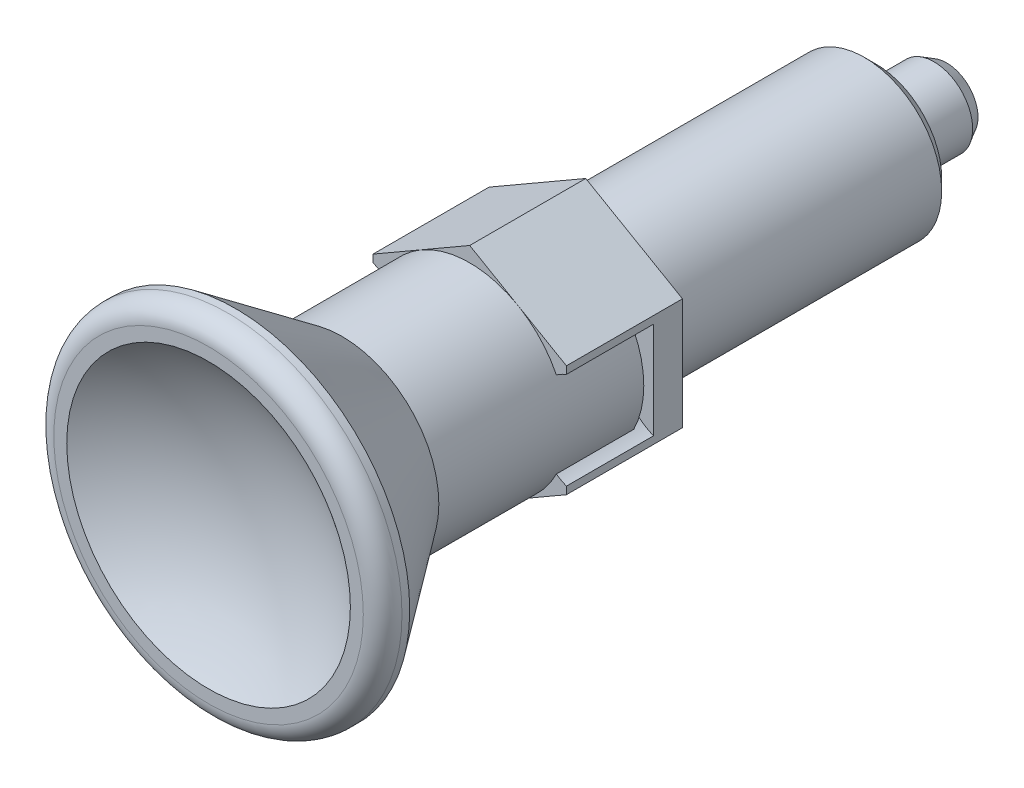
ISO-10303-21;
HEADER;
FILE_DESCRIPTION(('STEP AP214'),'2;1');
FILE_NAME('part.step','',(''),(''),'','','');
FILE_SCHEMA(('AUTOMOTIVE_DESIGN { 1 0 10303 214 1 1 1 1 }'));
ENDSEC;
DATA;
#1=APPLICATION_CONTEXT('core data for automotive mechanical design processes');
#2=APPLICATION_PROTOCOL_DEFINITION('international standard','automotive_design',2000,#1);
#3=PRODUCT_CONTEXT('',#1,'mechanical');
#4=PRODUCT('Part','Part','',(#3));
#5=PRODUCT_RELATED_PRODUCT_CATEGORY('part','',(#4));
#6=PRODUCT_DEFINITION_FORMATION('','',#4);
#7=PRODUCT_DEFINITION_CONTEXT('part definition',#1,'design');
#8=PRODUCT_DEFINITION('design','',#6,#7);
#9=PRODUCT_DEFINITION_SHAPE('','',#8);
#10=(LENGTH_UNIT() NAMED_UNIT(*) SI_UNIT(.MILLI.,.METRE.));
#11=(NAMED_UNIT(*) PLANE_ANGLE_UNIT() SI_UNIT($,.RADIAN.));
#12=(NAMED_UNIT(*) SI_UNIT($,.STERADIAN.) SOLID_ANGLE_UNIT());
#13=UNCERTAINTY_MEASURE_WITH_UNIT(LENGTH_MEASURE(1.E-05),#10,'distance_accuracy_value','');
#14=(GEOMETRIC_REPRESENTATION_CONTEXT(3) GLOBAL_UNCERTAINTY_ASSIGNED_CONTEXT((#13)) GLOBAL_UNIT_ASSIGNED_CONTEXT((#10,
#11,#12)) REPRESENTATION_CONTEXT('',''));
#15=CARTESIAN_POINT('',(0.,0.,0.));
#16=DIRECTION('',(0.,0.,1.));
#17=DIRECTION('',(1.,0.,0.));
#18=AXIS2_PLACEMENT_3D('',#15,#16,#17);
#19=CARTESIAN_POINT('',(-6.01980390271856,0.,1.5));
#20=DIRECTION('',(0.,0.,1.));
#21=DIRECTION('',(1.,0.,0.));
#22=AXIS2_PLACEMENT_3D('',#19,#20,#21);
#23=CYLINDRICAL_SURFACE('',#22,2.7);
#24=DIRECTION('',(0.,0.,1.));
#25=VECTOR('',#24,1.);
#26=CARTESIAN_POINT('',(-4.48088009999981,2.2184935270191,2.));
#27=LINE('',#26,#25);
#28=CARTESIAN_POINT('',(-4.48088009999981,2.21849352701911,2.));
#29=VERTEX_POINT('',#28);
#30=CARTESIAN_POINT('',(-4.48088009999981,2.2184935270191,6.));
#31=VERTEX_POINT('',#30);
#32=EDGE_CURVE('E131',#29,#31,#27,.T.);
#33=ORIENTED_EDGE('',*,*,#32,.T.);
#34=CARTESIAN_POINT('',(-6.01980390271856,0.,6.));
#35=DIRECTION('',(0.,0.,1.));
#36=DIRECTION('',(-1.,0.,0.));
#37=AXIS2_PLACEMENT_3D('',#34,#35,#36);
#38=CIRCLE('',#37,2.7);
#39=CARTESIAN_POINT('',(-5.,2.5,6.));
#40=VERTEX_POINT('',#39);
#41=EDGE_CURVE('E139',#31,#40,#38,.T.);
#42=ORIENTED_EDGE('',*,*,#41,.T.);
#43=DIRECTION('',(0.,0.,1.));
#44=VECTOR('',#43,1.);
#45=CARTESIAN_POINT('',(-5.,2.5,1.5));
#46=LINE('',#45,#44);
#47=CARTESIAN_POINT('',(-5.,2.5,1.5));
#48=VERTEX_POINT('',#47);
#49=EDGE_CURVE('E181',#48,#40,#46,.T.);
#50=ORIENTED_EDGE('',*,*,#49,.F.);
#51=CARTESIAN_POINT('',(-6.01980390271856,0.,1.5));
#52=DIRECTION('',(0.,0.,1.));
#53=DIRECTION('',(-1.,0.,0.));
#54=AXIS2_PLACEMENT_3D('',#51,#52,#53);
#55=CIRCLE('',#54,2.7);
#56=CARTESIAN_POINT('',(-5.,-2.5,1.5));
#57=VERTEX_POINT('',#56);
#58=EDGE_CURVE('E175',#57,#48,#55,.T.);
#59=ORIENTED_EDGE('',*,*,#58,.F.);
#60=DIRECTION('',(0.,0.,1.));
#61=VECTOR('',#60,1.);
#62=CARTESIAN_POINT('',(-5.,-2.5,1.5));
#63=LINE('',#62,#61);
#64=CARTESIAN_POINT('',(-5.,-2.5,6.));
#65=VERTEX_POINT('',#64);
#66=EDGE_CURVE('E182',#57,#65,#63,.T.);
#67=ORIENTED_EDGE('',*,*,#66,.T.);
#68=CARTESIAN_POINT('',(-4.48088009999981,-2.21849352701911,6.));
#69=VERTEX_POINT('',#68);
#70=EDGE_CURVE('E143',#65,#69,#38,.T.);
#71=ORIENTED_EDGE('',*,*,#70,.T.);
#72=DIRECTION('',(0.,0.,1.));
#73=VECTOR('',#72,1.);
#74=CARTESIAN_POINT('',(-4.48088009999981,-2.21849352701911,2.));
#75=LINE('',#74,#73);
#76=CARTESIAN_POINT('',(-4.48088009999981,-2.21849352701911,2.));
#77=VERTEX_POINT('',#76);
#78=EDGE_CURVE('E31',#77,#69,#75,.T.);
#79=ORIENTED_EDGE('',*,*,#78,.F.);
#80=CARTESIAN_POINT('',(-6.01980390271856,0.,2.));
#81=DIRECTION('',(0.,0.,-1.));
#82=DIRECTION('',(1.,0.,0.));
#83=AXIS2_PLACEMENT_3D('',#80,#81,#82);
#84=CIRCLE('',#83,2.7);
#85=EDGE_CURVE('E35',#29,#77,#84,.T.);
#86=ORIENTED_EDGE('',*,*,#85,.F.);
#87=EDGE_LOOP('',(#33,#42,#50,#59,#67,#71,#79,#86));
#88=FACE_BOUND('',#87,.T.);
#89=ADVANCED_FACE('F14',(#88),#23,.F.);
#90=CARTESIAN_POINT('',(6.01980390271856,0.,1.5));
#91=DIRECTION('',(0.,0.,1.));
#92=DIRECTION('',(1.,0.,0.));
#93=AXIS2_PLACEMENT_3D('',#90,#91,#92);
#94=CYLINDRICAL_SURFACE('',#93,2.7);
#95=DIRECTION('',(0.,0.,1.));
#96=VECTOR('',#95,1.);
#97=CARTESIAN_POINT('',(4.48088009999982,-2.2184935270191,2.));
#98=LINE('',#97,#96);
#99=CARTESIAN_POINT('',(4.48088009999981,-2.2184935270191,2.));
#100=VERTEX_POINT('',#99);
#101=CARTESIAN_POINT('',(4.48088009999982,-2.2184935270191,6.));
#102=VERTEX_POINT('',#101);
#103=EDGE_CURVE('E156',#100,#102,#98,.T.);
#104=ORIENTED_EDGE('',*,*,#103,.T.);
#105=CARTESIAN_POINT('',(6.01980390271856,0.,6.));
#106=DIRECTION('',(0.,0.,1.));
#107=DIRECTION('',(1.,0.,0.));
#108=AXIS2_PLACEMENT_3D('',#105,#106,#107);
#109=CIRCLE('',#108,2.7);
#110=CARTESIAN_POINT('',(5.,-2.5,6.));
#111=VERTEX_POINT('',#110);
#112=EDGE_CURVE('E162',#102,#111,#109,.T.);
#113=ORIENTED_EDGE('',*,*,#112,.T.);
#114=DIRECTION('',(0.,0.,1.));
#115=VECTOR('',#114,1.);
#116=CARTESIAN_POINT('',(5.,-2.5,1.5));
#117=LINE('',#116,#115);
#118=CARTESIAN_POINT('',(5.,-2.5,1.5));
#119=VERTEX_POINT('',#118);
#120=EDGE_CURVE('E171',#119,#111,#117,.T.);
#121=ORIENTED_EDGE('',*,*,#120,.F.);
#122=CARTESIAN_POINT('',(6.01980390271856,0.,1.5));
#123=DIRECTION('',(0.,0.,1.));
#124=DIRECTION('',(1.,0.,0.));
#125=AXIS2_PLACEMENT_3D('',#122,#123,#124);
#126=CIRCLE('',#125,2.7);
#127=CARTESIAN_POINT('',(5.,2.5,1.5));
#128=VERTEX_POINT('',#127);
#129=EDGE_CURVE('E165',#128,#119,#126,.T.);
#130=ORIENTED_EDGE('',*,*,#129,.F.);
#131=DIRECTION('',(0.,0.,1.));
#132=VECTOR('',#131,1.);
#133=CARTESIAN_POINT('',(5.,2.5,1.5));
#134=LINE('',#133,#132);
#135=CARTESIAN_POINT('',(5.,2.5,6.));
#136=VERTEX_POINT('',#135);
#137=EDGE_CURVE('E144',#128,#136,#134,.T.);
#138=ORIENTED_EDGE('',*,*,#137,.T.);
#139=CARTESIAN_POINT('',(4.48088009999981,2.21849352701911,6.));
#140=VERTEX_POINT('',#139);
#141=EDGE_CURVE('E163',#136,#140,#109,.T.);
#142=ORIENTED_EDGE('',*,*,#141,.T.);
#143=DIRECTION('',(0.,0.,1.));
#144=VECTOR('',#143,1.);
#145=CARTESIAN_POINT('',(4.48088009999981,2.2184935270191,2.));
#146=LINE('',#145,#144);
#147=CARTESIAN_POINT('',(4.48088009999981,2.2184935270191,2.));
#148=VERTEX_POINT('',#147);
#149=EDGE_CURVE('E159',#148,#140,#146,.T.);
#150=ORIENTED_EDGE('',*,*,#149,.F.);
#151=CARTESIAN_POINT('',(6.01980390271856,0.,2.));
#152=DIRECTION('',(0.,0.,-1.));
#153=DIRECTION('',(-1.,0.,0.));
#154=AXIS2_PLACEMENT_3D('',#151,#152,#153);
#155=CIRCLE('',#154,2.7);
#156=EDGE_CURVE('E146',#100,#148,#155,.T.);
#157=ORIENTED_EDGE('',*,*,#156,.F.);
#158=EDGE_LOOP('',(#104,#113,#121,#130,#138,#142,#150,#157));
#159=FACE_BOUND('',#158,.T.);
#160=ADVANCED_FACE('F307',(#159),#94,.F.);
#161=CARTESIAN_POINT('',(0.,0.,-15.));
#162=DIRECTION('',(0.,0.,1.));
#163=DIRECTION('',(1.,0.,0.));
#164=AXIS2_PLACEMENT_3D('',#161,#162,#163);
#165=SPHERICAL_SURFACE('',#164,4.);
#166=CARTESIAN_POINT('',(0.,0.,-18.656953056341));
#167=DIRECTION('',(0.,0.,1.));
#168=DIRECTION('',(1.,0.,0.));
#169=AXIS2_PLACEMENT_3D('',#166,#167,#168);
#170=CIRCLE('',#169,1.62070797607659);
#171=CARTESIAN_POINT('',(1.62070797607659,0.,-18.656953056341));
#172=VERTEX_POINT('',#171);
#173=EDGE_CURVE('E225',#172,#172,#170,.T.);
#174=ORIENTED_EDGE('',*,*,#173,.F.);
#175=EDGE_LOOP('',(#174));
#176=FACE_BOUND('',#175,.T.);
#177=ADVANCED_FACE('F16',(#176),#165,.T.);
#178=CARTESIAN_POINT('',(4.,0.,0.));
#179=DIRECTION('',(0.,0.,-1.));
#180=DIRECTION('',(-1.,0.,0.));
#181=AXIS2_PLACEMENT_3D('',#178,#179,#180);
#182=PLANE('',#181);
#183=CARTESIAN_POINT('',(0.,0.,0.));
#184=DIRECTION('',(0.,0.,1.));
#185=DIRECTION('',(1.,0.,0.));
#186=AXIS2_PLACEMENT_3D('',#183,#184,#185);
#187=CIRCLE('',#186,4.);
#188=CARTESIAN_POINT('',(4.,0.,0.));
#189=VERTEX_POINT('',#188);
#190=EDGE_CURVE('E254',#189,#189,#187,.T.);
#191=ORIENTED_EDGE('',*,*,#190,.T.);
#192=EDGE_LOOP('',(#191));
#193=FACE_BOUND('',#192,.T.);
#194=DIRECTION('',(0.866025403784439,-0.5,0.));
#195=VECTOR('',#194,1.);
#196=CARTESIAN_POINT('',(0.,5.77350269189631,0.));
#197=LINE('',#196,#195);
#198=CARTESIAN_POINT('',(0.,5.77350269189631,0.));
#199=VERTEX_POINT('',#198);
#200=CARTESIAN_POINT('',(5.,2.88675134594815,0.));
#201=VERTEX_POINT('',#200);
#202=EDGE_CURVE('E193',#199,#201,#197,.T.);
#203=ORIENTED_EDGE('',*,*,#202,.T.);
#204=DIRECTION('',(0.,-1.,0.));
#205=VECTOR('',#204,1.);
#206=CARTESIAN_POINT('',(5.,2.88675134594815,0.));
#207=LINE('',#206,#205);
#208=CARTESIAN_POINT('',(5.,-2.88675134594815,0.));
#209=VERTEX_POINT('',#208);
#210=EDGE_CURVE('E196',#201,#209,#207,.T.);
#211=ORIENTED_EDGE('',*,*,#210,.T.);
#212=DIRECTION('',(-0.866025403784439,-0.5,0.));
#213=VECTOR('',#212,1.);
#214=CARTESIAN_POINT('',(5.,-2.88675134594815,0.));
#215=LINE('',#214,#213);
#216=CARTESIAN_POINT('',(0.,-5.77350269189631,0.));
#217=VERTEX_POINT('',#216);
#218=EDGE_CURVE('E184',#209,#217,#215,.T.);
#219=ORIENTED_EDGE('',*,*,#218,.T.);
#220=DIRECTION('',(-0.866025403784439,0.5,0.));
#221=VECTOR('',#220,1.);
#222=CARTESIAN_POINT('',(0.,-5.77350269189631,0.));
#223=LINE('',#222,#221);
#224=CARTESIAN_POINT('',(-5.,-2.88675134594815,0.));
#225=VERTEX_POINT('',#224);
#226=EDGE_CURVE('E187',#217,#225,#223,.T.);
#227=ORIENTED_EDGE('',*,*,#226,.T.);
#228=DIRECTION('',(0.,1.,0.));
#229=VECTOR('',#228,1.);
#230=CARTESIAN_POINT('',(-5.,-2.88675134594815,0.));
#231=LINE('',#230,#229);
#232=CARTESIAN_POINT('',(-5.,2.88675134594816,0.));
#233=VERTEX_POINT('',#232);
#234=EDGE_CURVE('E189',#225,#233,#231,.T.);
#235=ORIENTED_EDGE('',*,*,#234,.T.);
#236=DIRECTION('',(0.866025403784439,0.5,0.));
#237=VECTOR('',#236,1.);
#238=CARTESIAN_POINT('',(-5.,2.88675134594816,0.));
#239=LINE('',#238,#237);
#240=EDGE_CURVE('E191',#233,#199,#239,.T.);
#241=ORIENTED_EDGE('',*,*,#240,.T.);
#242=EDGE_LOOP('',(#203,#211,#219,#227,#235,#241));
#243=FACE_BOUND('',#242,.T.);
#244=ADVANCED_FACE('F378',(#193,#243),#182,.T.);
#245=CARTESIAN_POINT('',(0.,0.,20.9596108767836));
#246=DIRECTION('',(0.,0.,1.));
#247=DIRECTION('',(1.,0.,0.));
#248=AXIS2_PLACEMENT_3D('',#245,#246,#247);
#249=CYLINDRICAL_SURFACE('',#248,4.);
#250=CARTESIAN_POINT('',(0.,0.,-14.4));
#251=DIRECTION('',(0.,0.,1.));
#252=DIRECTION('',(1.,0.,0.));
#253=AXIS2_PLACEMENT_3D('',#250,#251,#252);
#254=CIRCLE('',#253,4.);
#255=CARTESIAN_POINT('',(4.,0.,-14.4));
#256=VERTEX_POINT('',#255);
#257=EDGE_CURVE('E251',#256,#256,#254,.T.);
#258=ORIENTED_EDGE('',*,*,#257,.T.);
#259=EDGE_LOOP('',(#258));
#260=FACE_BOUND('',#259,.T.);
#261=ORIENTED_EDGE('',*,*,#190,.F.);
#262=EDGE_LOOP('',(#261));
#263=FACE_BOUND('',#262,.T.);
#264=ADVANCED_FACE('F374',(#260,#263),#249,.T.);
#265=CARTESIAN_POINT('',(0.,0.,-14.4));
#266=DIRECTION('',(0.,0.,1.));
#267=DIRECTION('',(1.,0.,0.));
#268=AXIS2_PLACEMENT_3D('',#265,#266,#267);
#269=CONICAL_SURFACE('',#268,4.,0.785398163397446);
#270=CARTESIAN_POINT('',(0.,0.,-15.));
#271=DIRECTION('',(0.,0.,1.));
#272=DIRECTION('',(1.,0.,0.));
#273=AXIS2_PLACEMENT_3D('',#270,#271,#272);
#274=CIRCLE('',#273,3.4);
#275=CARTESIAN_POINT('',(3.4,0.,-15.));
#276=VERTEX_POINT('',#275);
#277=EDGE_CURVE('E248',#276,#276,#274,.T.);
#278=ORIENTED_EDGE('',*,*,#277,.T.);
#279=EDGE_LOOP('',(#278));
#280=FACE_BOUND('',#279,.T.);
#281=ORIENTED_EDGE('',*,*,#257,.F.);
#282=EDGE_LOOP('',(#281));
#283=FACE_BOUND('',#282,.T.);
#284=ADVANCED_FACE('F370',(#280,#283),#269,.T.);
#285=CARTESIAN_POINT('',(3.4,0.,-15.));
#286=DIRECTION('',(0.,0.,-1.));
#287=DIRECTION('',(-1.,0.,0.));
#288=AXIS2_PLACEMENT_3D('',#285,#286,#287);
#289=PLANE('',#288);
#290=CARTESIAN_POINT('',(0.,0.,-15.));
#291=DIRECTION('',(0.,0.,1.));
#292=DIRECTION('',(1.,0.,0.));
#293=AXIS2_PLACEMENT_3D('',#290,#291,#292);
#294=CIRCLE('',#293,2.);
#295=CARTESIAN_POINT('',(2.,0.,-15.));
#296=VERTEX_POINT('',#295);
#297=EDGE_CURVE('E245',#296,#296,#294,.T.);
#298=ORIENTED_EDGE('',*,*,#297,.T.);
#299=EDGE_LOOP('',(#298));
#300=FACE_BOUND('',#299,.T.);
#301=ORIENTED_EDGE('',*,*,#277,.F.);
#302=EDGE_LOOP('',(#301));
#303=FACE_BOUND('',#302,.T.);
#304=ADVANCED_FACE('F366',(#300,#303),#289,.T.);
#305=CARTESIAN_POINT('',(0.,0.,20.9596108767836));
#306=DIRECTION('',(0.,0.,1.));
#307=DIRECTION('',(1.,0.,0.));
#308=AXIS2_PLACEMENT_3D('',#305,#306,#307);
#309=CYLINDRICAL_SURFACE('',#308,2.);
#310=CARTESIAN_POINT('',(0.,0.,-18.));
#311=DIRECTION('',(0.,0.,1.));
#312=DIRECTION('',(1.,0.,0.));
#313=AXIS2_PLACEMENT_3D('',#310,#311,#312);
#314=CIRCLE('',#313,2.);
#315=CARTESIAN_POINT('',(2.,0.,-18.));
#316=VERTEX_POINT('',#315);
#317=EDGE_CURVE('E242',#316,#316,#314,.T.);
#318=ORIENTED_EDGE('',*,*,#317,.T.);
#319=EDGE_LOOP('',(#318));
#320=FACE_BOUND('',#319,.T.);
#321=ORIENTED_EDGE('',*,*,#297,.F.);
#322=EDGE_LOOP('',(#321));
#323=FACE_BOUND('',#322,.T.);
#324=ADVANCED_FACE('F362',(#320,#323),#309,.T.);
#325=CARTESIAN_POINT('',(0.,0.,-18.));
#326=DIRECTION('',(0.,0.,1.));
#327=DIRECTION('',(1.,0.,0.));
#328=AXIS2_PLACEMENT_3D('',#325,#326,#327);
#329=CONICAL_SURFACE('',#328,2.,0.523598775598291);
#330=ORIENTED_EDGE('',*,*,#173,.T.);
#331=EDGE_LOOP('',(#330));
#332=FACE_BOUND('',#331,.T.);
#333=ORIENTED_EDGE('',*,*,#317,.F.);
#334=EDGE_LOOP('',(#333));
#335=FACE_BOUND('',#334,.T.);
#336=ADVANCED_FACE('F359',(#332,#335),#329,.T.);
#337=CARTESIAN_POINT('',(10.,0.,6.));
#338=DIRECTION('',(0.,0.,1.));
#339=DIRECTION('',(1.,0.,0.));
#340=AXIS2_PLACEMENT_3D('',#337,#338,#339);
#341=PLANE('',#340);
#342=ORIENTED_EDGE('',*,*,#112,.F.);
#343=CARTESIAN_POINT('',(0.,0.,6.));
#344=DIRECTION('',(0.,0.,1.));
#345=DIRECTION('',(1.,0.,0.));
#346=AXIS2_PLACEMENT_3D('',#343,#344,#345);
#347=CIRCLE('',#346,5.);
#348=CARTESIAN_POINT('',(2.5,-4.33012701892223,6.));
#349=VERTEX_POINT('',#348);
#350=EDGE_CURVE('E9',#102,#349,#347,.F.);
#351=ORIENTED_EDGE('',*,*,#350,.T.);
#352=DIRECTION('',(-0.866025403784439,-0.5,0.));
#353=VECTOR('',#352,1.);
#354=CARTESIAN_POINT('',(5.,-2.88675134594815,6.));
#355=LINE('',#354,#353);
#356=CARTESIAN_POINT('',(5.,-2.88675134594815,6.));
#357=VERTEX_POINT('',#356);
#358=EDGE_CURVE('E199',#357,#349,#355,.T.);
#359=ORIENTED_EDGE('',*,*,#358,.F.);
#360=DIRECTION('',(0.,-1.,0.));
#361=VECTOR('',#360,1.);
#362=CARTESIAN_POINT('',(5.,2.88675134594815,6.));
#363=LINE('',#362,#361);
#364=EDGE_CURVE('E217',#111,#357,#363,.T.);
#365=ORIENTED_EDGE('',*,*,#364,.F.);
#366=EDGE_LOOP('',(#342,#351,#359,#365));
#367=FACE_BOUND('',#366,.T.);
#368=ADVANCED_FACE('F303',(#367),#341,.T.);
#369=CARTESIAN_POINT('',(0.,-5.77350269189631,6.));
#370=VERTEX_POINT('',#369);
#371=EDGE_CURVE('E198',#349,#370,#355,.T.);
#372=ORIENTED_EDGE('',*,*,#371,.F.);
#373=CARTESIAN_POINT('',(-2.5,-4.33012701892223,6.));
#374=VERTEX_POINT('',#373);
#375=EDGE_CURVE('E23',#349,#374,#347,.F.);
#376=ORIENTED_EDGE('',*,*,#375,.T.);
#377=DIRECTION('',(-0.866025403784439,0.5,0.));
#378=VECTOR('',#377,1.);
#379=CARTESIAN_POINT('',(0.,-5.77350269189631,6.));
#380=LINE('',#379,#378);
#381=EDGE_CURVE('E203',#370,#374,#380,.T.);
#382=ORIENTED_EDGE('',*,*,#381,.F.);
#383=EDGE_LOOP('',(#372,#376,#382));
#384=FACE_BOUND('',#383,.T.);
#385=ADVANCED_FACE('F287',(#384),#341,.T.);
#386=ORIENTED_EDGE('',*,*,#70,.F.);
#387=DIRECTION('',(0.,1.,0.));
#388=VECTOR('',#387,1.);
#389=CARTESIAN_POINT('',(-5.,-2.88675134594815,6.));
#390=LINE('',#389,#388);
#391=CARTESIAN_POINT('',(-5.,-2.88675134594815,6.));
#392=VERTEX_POINT('',#391);
#393=EDGE_CURVE('E206',#392,#65,#390,.T.);
#394=ORIENTED_EDGE('',*,*,#393,.F.);
#395=EDGE_CURVE('E202',#374,#392,#380,.T.);
#396=ORIENTED_EDGE('',*,*,#395,.F.);
#397=EDGE_CURVE('E137',#374,#69,#347,.F.);
#398=ORIENTED_EDGE('',*,*,#397,.T.);
#399=EDGE_LOOP('',(#386,#394,#396,#398));
#400=FACE_BOUND('',#399,.T.);
#401=ADVANCED_FACE('F289',(#400),#341,.T.);
#402=ORIENTED_EDGE('',*,*,#41,.F.);
#403=CARTESIAN_POINT('',(-2.5,4.33012701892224,6.));
#404=VERTEX_POINT('',#403);
#405=EDGE_CURVE('E24',#31,#404,#347,.F.);
#406=ORIENTED_EDGE('',*,*,#405,.T.);
#407=DIRECTION('',(0.866025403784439,0.5,0.));
#408=VECTOR('',#407,1.);
#409=CARTESIAN_POINT('',(-5.,2.88675134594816,6.));
#410=LINE('',#409,#408);
#411=CARTESIAN_POINT('',(-5.,2.88675134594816,6.));
#412=VERTEX_POINT('',#411);
#413=EDGE_CURVE('E210',#412,#404,#410,.T.);
#414=ORIENTED_EDGE('',*,*,#413,.F.);
#415=EDGE_CURVE('E141',#40,#412,#390,.T.);
#416=ORIENTED_EDGE('',*,*,#415,.F.);
#417=EDGE_LOOP('',(#402,#406,#414,#416));
#418=FACE_BOUND('',#417,.T.);
#419=ADVANCED_FACE('F140',(#418),#341,.T.);
#420=CARTESIAN_POINT('',(0.,5.77350269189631,6.));
#421=VERTEX_POINT('',#420);
#422=EDGE_CURVE('E209',#404,#421,#410,.T.);
#423=ORIENTED_EDGE('',*,*,#422,.F.);
#424=CARTESIAN_POINT('',(2.5,4.33012701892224,6.));
#425=VERTEX_POINT('',#424);
#426=EDGE_CURVE('E133',#404,#425,#347,.F.);
#427=ORIENTED_EDGE('',*,*,#426,.T.);
#428=DIRECTION('',(0.866025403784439,-0.5,0.));
#429=VECTOR('',#428,1.);
#430=CARTESIAN_POINT('',(0.,5.77350269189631,6.));
#431=LINE('',#430,#429);
#432=EDGE_CURVE('E214',#421,#425,#431,.T.);
#433=ORIENTED_EDGE('',*,*,#432,.F.);
#434=EDGE_LOOP('',(#423,#427,#433));
#435=FACE_BOUND('',#434,.T.);
#436=ADVANCED_FACE('F338',(#435),#341,.T.);
#437=CARTESIAN_POINT('',(5.,-2.88675134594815,6.));
#438=DIRECTION('',(0.5,-0.866025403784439,0.));
#439=DIRECTION('',(0.866025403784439,0.5,0.));
#440=AXIS2_PLACEMENT_3D('',#437,#438,#439);
#441=PLANE('',#440);
#442=DIRECTION('',(0.,0.,-1.));
#443=VECTOR('',#442,1.);
#444=CARTESIAN_POINT('',(0.,-5.77350269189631,6.));
#445=LINE('',#444,#443);
#446=EDGE_CURVE('E221',#370,#217,#445,.T.);
#447=ORIENTED_EDGE('',*,*,#446,.T.);
#448=ORIENTED_EDGE('',*,*,#218,.F.);
#449=DIRECTION('',(0.,0.,-1.));
#450=VECTOR('',#449,1.);
#451=CARTESIAN_POINT('',(5.,-2.88675134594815,6.));
#452=LINE('',#451,#450);
#453=EDGE_CURVE('E222',#357,#209,#452,.T.);
#454=ORIENTED_EDGE('',*,*,#453,.F.);
#455=ORIENTED_EDGE('',*,*,#358,.T.);
#456=ORIENTED_EDGE('',*,*,#371,.T.);
#457=EDGE_LOOP('',(#447,#448,#454,#455,#456));
#458=FACE_BOUND('',#457,.T.);
#459=ADVANCED_FACE('F297',(#458),#441,.T.);
#460=CARTESIAN_POINT('',(5.,2.88675134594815,6.));
#461=DIRECTION('',(1.,0.,0.));
#462=DIRECTION('',(0.,0.,-1.));
#463=AXIS2_PLACEMENT_3D('',#460,#461,#462);
#464=PLANE('',#463);
#465=ORIENTED_EDGE('',*,*,#137,.F.);
#466=DIRECTION('',(0.,1.,0.));
#467=VECTOR('',#466,1.);
#468=CARTESIAN_POINT('',(5.,2.5,1.5));
#469=LINE('',#468,#467);
#470=EDGE_CURVE('E168',#119,#128,#469,.T.);
#471=ORIENTED_EDGE('',*,*,#470,.F.);
#472=ORIENTED_EDGE('',*,*,#120,.T.);
#473=ORIENTED_EDGE('',*,*,#364,.T.);
#474=ORIENTED_EDGE('',*,*,#453,.T.);
#475=ORIENTED_EDGE('',*,*,#210,.F.);
#476=DIRECTION('',(0.,0.,-1.));
#477=VECTOR('',#476,1.);
#478=CARTESIAN_POINT('',(5.,2.88675134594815,6.));
#479=LINE('',#478,#477);
#480=CARTESIAN_POINT('',(5.,2.88675134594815,6.));
#481=VERTEX_POINT('',#480);
#482=EDGE_CURVE('E226',#481,#201,#479,.T.);
#483=ORIENTED_EDGE('',*,*,#482,.F.);
#484=EDGE_CURVE('E218',#481,#136,#363,.T.);
#485=ORIENTED_EDGE('',*,*,#484,.T.);
#486=EDGE_LOOP('',(#465,#471,#472,#473,#474,#475,#483,#485));
#487=FACE_BOUND('',#486,.T.);
#488=ADVANCED_FACE('F339',(#487),#464,.T.);
#489=CARTESIAN_POINT('',(0.,5.77350269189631,6.));
#490=DIRECTION('',(0.5,0.866025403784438,0.));
#491=DIRECTION('',(-0.866025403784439,0.5,0.));
#492=AXIS2_PLACEMENT_3D('',#489,#490,#491);
#493=PLANE('',#492);
#494=ORIENTED_EDGE('',*,*,#482,.T.);
#495=ORIENTED_EDGE('',*,*,#202,.F.);
#496=DIRECTION('',(0.,0.,-1.));
#497=VECTOR('',#496,1.);
#498=CARTESIAN_POINT('',(0.,5.77350269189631,6.));
#499=LINE('',#498,#497);
#500=EDGE_CURVE('E229',#421,#199,#499,.T.);
#501=ORIENTED_EDGE('',*,*,#500,.F.);
#502=ORIENTED_EDGE('',*,*,#432,.T.);
#503=EDGE_CURVE('E213',#425,#481,#431,.T.);
#504=ORIENTED_EDGE('',*,*,#503,.T.);
#505=EDGE_LOOP('',(#494,#495,#501,#502,#504));
#506=FACE_BOUND('',#505,.T.);
#507=ADVANCED_FACE('F342',(#506),#493,.T.);
#508=CARTESIAN_POINT('',(-5.,2.88675134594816,6.));
#509=DIRECTION('',(-0.5,0.866025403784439,0.));
#510=DIRECTION('',(-0.866025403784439,-0.5,0.));
#511=AXIS2_PLACEMENT_3D('',#508,#509,#510);
#512=PLANE('',#511);
#513=ORIENTED_EDGE('',*,*,#500,.T.);
#514=ORIENTED_EDGE('',*,*,#240,.F.);
#515=DIRECTION('',(0.,0.,-1.));
#516=VECTOR('',#515,1.);
#517=CARTESIAN_POINT('',(-5.,2.88675134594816,6.));
#518=LINE('',#517,#516);
#519=EDGE_CURVE('E232',#412,#233,#518,.T.);
#520=ORIENTED_EDGE('',*,*,#519,.F.);
#521=ORIENTED_EDGE('',*,*,#413,.T.);
#522=ORIENTED_EDGE('',*,*,#422,.T.);
#523=EDGE_LOOP('',(#513,#514,#520,#521,#522));
#524=FACE_BOUND('',#523,.T.);
#525=ADVANCED_FACE('F346',(#524),#512,.T.);
#526=CARTESIAN_POINT('',(-5.,-2.88675134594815,6.));
#527=DIRECTION('',(-1.,0.,0.));
#528=DIRECTION('',(0.,-1.,0.));
#529=AXIS2_PLACEMENT_3D('',#526,#527,#528);
#530=PLANE('',#529);
#531=ORIENTED_EDGE('',*,*,#66,.F.);
#532=DIRECTION('',(0.,-1.,0.));
#533=VECTOR('',#532,1.);
#534=CARTESIAN_POINT('',(-5.,2.5,1.5));
#535=LINE('',#534,#533);
#536=EDGE_CURVE('E178',#48,#57,#535,.T.);
#537=ORIENTED_EDGE('',*,*,#536,.F.);
#538=ORIENTED_EDGE('',*,*,#49,.T.);
#539=ORIENTED_EDGE('',*,*,#415,.T.);
#540=ORIENTED_EDGE('',*,*,#519,.T.);
#541=ORIENTED_EDGE('',*,*,#234,.F.);
#542=DIRECTION('',(0.,0.,-1.));
#543=VECTOR('',#542,1.);
#544=CARTESIAN_POINT('',(-5.,-2.88675134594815,6.));
#545=LINE('',#544,#543);
#546=EDGE_CURVE('E235',#392,#225,#545,.T.);
#547=ORIENTED_EDGE('',*,*,#546,.F.);
#548=ORIENTED_EDGE('',*,*,#393,.T.);
#549=EDGE_LOOP('',(#531,#537,#538,#539,#540,#541,#547,#548));
#550=FACE_BOUND('',#549,.T.);
#551=ADVANCED_FACE('F350',(#550),#530,.T.);
#552=CARTESIAN_POINT('',(0.,-5.77350269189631,6.));
#553=DIRECTION('',(-0.5,-0.866025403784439,0.));
#554=DIRECTION('',(0.866025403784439,-0.5,0.));
#555=AXIS2_PLACEMENT_3D('',#552,#553,#554);
#556=PLANE('',#555);
#557=ORIENTED_EDGE('',*,*,#546,.T.);
#558=ORIENTED_EDGE('',*,*,#226,.F.);
#559=ORIENTED_EDGE('',*,*,#446,.F.);
#560=ORIENTED_EDGE('',*,*,#381,.T.);
#561=ORIENTED_EDGE('',*,*,#395,.T.);
#562=EDGE_LOOP('',(#557,#558,#559,#560,#561));
#563=FACE_BOUND('',#562,.T.);
#564=ADVANCED_FACE('F293',(#563),#556,.T.);
#565=ORIENTED_EDGE('',*,*,#141,.F.);
#566=ORIENTED_EDGE('',*,*,#484,.F.);
#567=ORIENTED_EDGE('',*,*,#503,.F.);
#568=EDGE_CURVE('E18',#425,#140,#347,.F.);
#569=ORIENTED_EDGE('',*,*,#568,.T.);
#570=EDGE_LOOP('',(#565,#566,#567,#569));
#571=FACE_BOUND('',#570,.T.);
#572=ADVANCED_FACE('F334',(#571),#341,.T.);
#573=CARTESIAN_POINT('',(0.,0.,29.));
#574=DIRECTION('',(0.,0.,1.));
#575=DIRECTION('',(1.,0.,0.));
#576=AXIS2_PLACEMENT_3D('',#573,#574,#575);
#577=SPHERICAL_SURFACE('',#576,12.);
#578=CARTESIAN_POINT('',(0.,0.,19.5));
#579=DIRECTION('',(0.,0.,1.));
#580=DIRECTION('',(1.,0.,0.));
#581=AXIS2_PLACEMENT_3D('',#578,#579,#580);
#582=CIRCLE('',#581,7.33143914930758);
#583=CARTESIAN_POINT('',(7.33143914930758,0.,19.5));
#584=VERTEX_POINT('',#583);
#585=EDGE_CURVE('E268',#584,#584,#582,.T.);
#586=ORIENTED_EDGE('',*,*,#585,.T.);
#587=EDGE_LOOP('',(#586));
#588=FACE_BOUND('',#587,.T.);
#589=ADVANCED_FACE('F337',(#588),#577,.F.);
#590=CARTESIAN_POINT('',(8.,0.,19.5));
#591=DIRECTION('',(0.,0.,1.));
#592=DIRECTION('',(1.,0.,0.));
#593=AXIS2_PLACEMENT_3D('',#590,#591,#592);
#594=PLANE('',#593);
#595=CARTESIAN_POINT('',(0.,0.,19.5));
#596=DIRECTION('',(0.,0.,1.));
#597=DIRECTION('',(1.,0.,0.));
#598=AXIS2_PLACEMENT_3D('',#595,#596,#597);
#599=CIRCLE('',#598,8.);
#600=CARTESIAN_POINT('',(8.,0.,19.5));
#601=VERTEX_POINT('',#600);
#602=EDGE_CURVE('E266',#601,#601,#599,.T.);
#603=ORIENTED_EDGE('',*,*,#602,.T.);
#604=EDGE_LOOP('',(#603));
#605=FACE_BOUND('',#604,.T.);
#606=ORIENTED_EDGE('',*,*,#585,.F.);
#607=EDGE_LOOP('',(#606));
#608=FACE_BOUND('',#607,.T.);
#609=ADVANCED_FACE('F396',(#605,#608),#594,.T.);
#610=CARTESIAN_POINT('',(0.,0.,18.5));
#611=DIRECTION('',(0.,0.,1.));
#612=DIRECTION('',(1.,0.,0.));
#613=AXIS2_PLACEMENT_3D('',#610,#611,#612);
#614=TOROIDAL_SURFACE('',#613,8.,1.);
#615=CARTESIAN_POINT('',(0.,0.,18.5));
#616=DIRECTION('',(0.,0.,1.));
#617=DIRECTION('',(1.,0.,0.));
#618=AXIS2_PLACEMENT_3D('',#615,#616,#617);
#619=CIRCLE('',#618,9.);
#620=CARTESIAN_POINT('',(9.,0.,18.5));
#621=VERTEX_POINT('',#620);
#622=EDGE_CURVE('E263',#621,#621,#619,.T.);
#623=ORIENTED_EDGE('',*,*,#622,.T.);
#624=EDGE_LOOP('',(#623));
#625=FACE_BOUND('',#624,.T.);
#626=ORIENTED_EDGE('',*,*,#602,.F.);
#627=EDGE_LOOP('',(#626));
#628=FACE_BOUND('',#627,.T.);
#629=ADVANCED_FACE('F392',(#625,#628),#614,.T.);
#630=CARTESIAN_POINT('',(0.,0.,20.9596108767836));
#631=DIRECTION('',(0.,0.,1.));
#632=DIRECTION('',(1.,0.,0.));
#633=AXIS2_PLACEMENT_3D('',#630,#631,#632);
#634=CYLINDRICAL_SURFACE('',#633,9.);
#635=CARTESIAN_POINT('',(0.,0.,18.1));
#636=DIRECTION('',(0.,0.,1.));
#637=DIRECTION('',(1.,0.,0.));
#638=AXIS2_PLACEMENT_3D('',#635,#636,#637);
#639=CIRCLE('',#638,9.);
#640=CARTESIAN_POINT('',(9.,0.,18.1));
#641=VERTEX_POINT('',#640);
#642=EDGE_CURVE('E260',#641,#641,#639,.T.);
#643=ORIENTED_EDGE('',*,*,#642,.T.);
#644=EDGE_LOOP('',(#643));
#645=FACE_BOUND('',#644,.T.);
#646=ORIENTED_EDGE('',*,*,#622,.F.);
#647=EDGE_LOOP('',(#646));
#648=FACE_BOUND('',#647,.T.);
#649=ADVANCED_FACE('F388',(#645,#648),#634,.T.);
#650=CARTESIAN_POINT('',(0.,0.,18.1));
#651=DIRECTION('',(0.,0.,1.));
#652=DIRECTION('',(1.,0.,0.));
#653=AXIS2_PLACEMENT_3D('',#650,#651,#652);
#654=CONICAL_SURFACE('',#653,9.,0.628318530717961);
#655=CARTESIAN_POINT('',(0.,0.,12.5944723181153));
#656=DIRECTION('',(0.,0.,1.));
#657=DIRECTION('',(1.,0.,0.));
#658=AXIS2_PLACEMENT_3D('',#655,#656,#657);
#659=CIRCLE('',#658,5.);
#660=CARTESIAN_POINT('',(5.,0.,12.5944723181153));
#661=VERTEX_POINT('',#660);
#662=EDGE_CURVE('E257',#661,#661,#659,.T.);
#663=ORIENTED_EDGE('',*,*,#662,.T.);
#664=EDGE_LOOP('',(#663));
#665=FACE_BOUND('',#664,.T.);
#666=ORIENTED_EDGE('',*,*,#642,.F.);
#667=EDGE_LOOP('',(#666));
#668=FACE_BOUND('',#667,.T.);
#669=ADVANCED_FACE('F385',(#665,#668),#654,.T.);
#670=CARTESIAN_POINT('',(0.,0.,20.9596108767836));
#671=DIRECTION('',(0.,0.,1.));
#672=DIRECTION('',(1.,0.,0.));
#673=AXIS2_PLACEMENT_3D('',#670,#671,#672);
#674=CYLINDRICAL_SURFACE('',#673,5.);
#675=ORIENTED_EDGE('',*,*,#350,.F.);
#676=ORIENTED_EDGE('',*,*,#103,.F.);
#677=CARTESIAN_POINT('',(0.,0.,2.));
#678=DIRECTION('',(0.,0.,-1.));
#679=DIRECTION('',(-1.,0.,0.));
#680=AXIS2_PLACEMENT_3D('',#677,#678,#679);
#681=CIRCLE('',#680,5.);
#682=EDGE_CURVE('E149',#148,#100,#681,.T.);
#683=ORIENTED_EDGE('',*,*,#682,.F.);
#684=ORIENTED_EDGE('',*,*,#149,.T.);
#685=ORIENTED_EDGE('',*,*,#568,.F.);
#686=ORIENTED_EDGE('',*,*,#426,.F.);
#687=ORIENTED_EDGE('',*,*,#405,.F.);
#688=ORIENTED_EDGE('',*,*,#32,.F.);
#689=CARTESIAN_POINT('',(0.,0.,2.));
#690=DIRECTION('',(0.,0.,-1.));
#691=DIRECTION('',(1.,0.,0.));
#692=AXIS2_PLACEMENT_3D('',#689,#690,#691);
#693=CIRCLE('',#692,5.);
#694=EDGE_CURVE('E628',#77,#29,#693,.T.);
#695=ORIENTED_EDGE('',*,*,#694,.F.);
#696=ORIENTED_EDGE('',*,*,#78,.T.);
#697=ORIENTED_EDGE('',*,*,#397,.F.);
#698=ORIENTED_EDGE('',*,*,#375,.F.);
#699=EDGE_LOOP('',(#675,#676,#683,#684,#685,#686,#687,#688,#695,#696,#697,#698));
#700=FACE_BOUND('',#699,.T.);
#701=ORIENTED_EDGE('',*,*,#662,.F.);
#702=EDGE_LOOP('',(#701));
#703=FACE_BOUND('',#702,.T.);
#704=ADVANCED_FACE('F128',(#700,#703),#674,.T.);
#705=CARTESIAN_POINT('',(-6.01980390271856,0.,1.5));
#706=DIRECTION('',(0.,0.,-1.));
#707=DIRECTION('',(-1.,0.,0.));
#708=AXIS2_PLACEMENT_3D('',#705,#706,#707);
#709=PLANE('',#708);
#710=ORIENTED_EDGE('',*,*,#58,.T.);
#711=ORIENTED_EDGE('',*,*,#536,.T.);
#712=EDGE_LOOP('',(#710,#711));
#713=FACE_BOUND('',#712,.T.);
#714=ADVANCED_FACE('F322',(#713),#709,.F.);
#715=CARTESIAN_POINT('',(6.01980390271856,0.,1.5));
#716=DIRECTION('',(0.,0.,1.));
#717=DIRECTION('',(1.,0.,0.));
#718=AXIS2_PLACEMENT_3D('',#715,#716,#717);
#719=PLANE('',#718);
#720=ORIENTED_EDGE('',*,*,#129,.T.);
#721=ORIENTED_EDGE('',*,*,#470,.T.);
#722=EDGE_LOOP('',(#720,#721));
#723=FACE_BOUND('',#722,.T.);
#724=ADVANCED_FACE('F312',(#723),#719,.T.);
#725=CARTESIAN_POINT('',(3.00990195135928,0.,2.));
#726=DIRECTION('',(0.,0.,-1.));
#727=DIRECTION('',(-1.,0.,0.));
#728=AXIS2_PLACEMENT_3D('',#725,#726,#727);
#729=PLANE('',#728);
#730=ORIENTED_EDGE('',*,*,#156,.T.);
#731=ORIENTED_EDGE('',*,*,#682,.T.);
#732=EDGE_LOOP('',(#730,#731));
#733=FACE_BOUND('',#732,.T.);
#734=ADVANCED_FACE('F309',(#733),#729,.T.);
#735=CARTESIAN_POINT('',(-3.00990195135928,0.,2.));
#736=DIRECTION('',(0.,0.,1.));
#737=DIRECTION('',(1.,0.,0.));
#738=AXIS2_PLACEMENT_3D('',#735,#736,#737);
#739=PLANE('',#738);
#740=ORIENTED_EDGE('',*,*,#694,.T.);
#741=ORIENTED_EDGE('',*,*,#85,.T.);
#742=EDGE_LOOP('',(#740,#741));
#743=FACE_BOUND('',#742,.T.);
#744=ADVANCED_FACE('F311',(#743),#739,.F.);
#745=CLOSED_SHELL('',(#89,#160,#177,#244,#264,#284,#304,#324,#336,#368,#385,#401,#419,#436,#459,
#488,#507,#525,#551,#564,#572,#589,#609,#629,#649,#669,#704,#714,#724,#734,#744));
#746=MANIFOLD_SOLID_BREP('B1',#745);
#747=ADVANCED_BREP_SHAPE_REPRESENTATION('',(#18,#746),#14);
#748=SHAPE_DEFINITION_REPRESENTATION(#9,#747);
ENDSEC;
END-ISO-10303-21;
